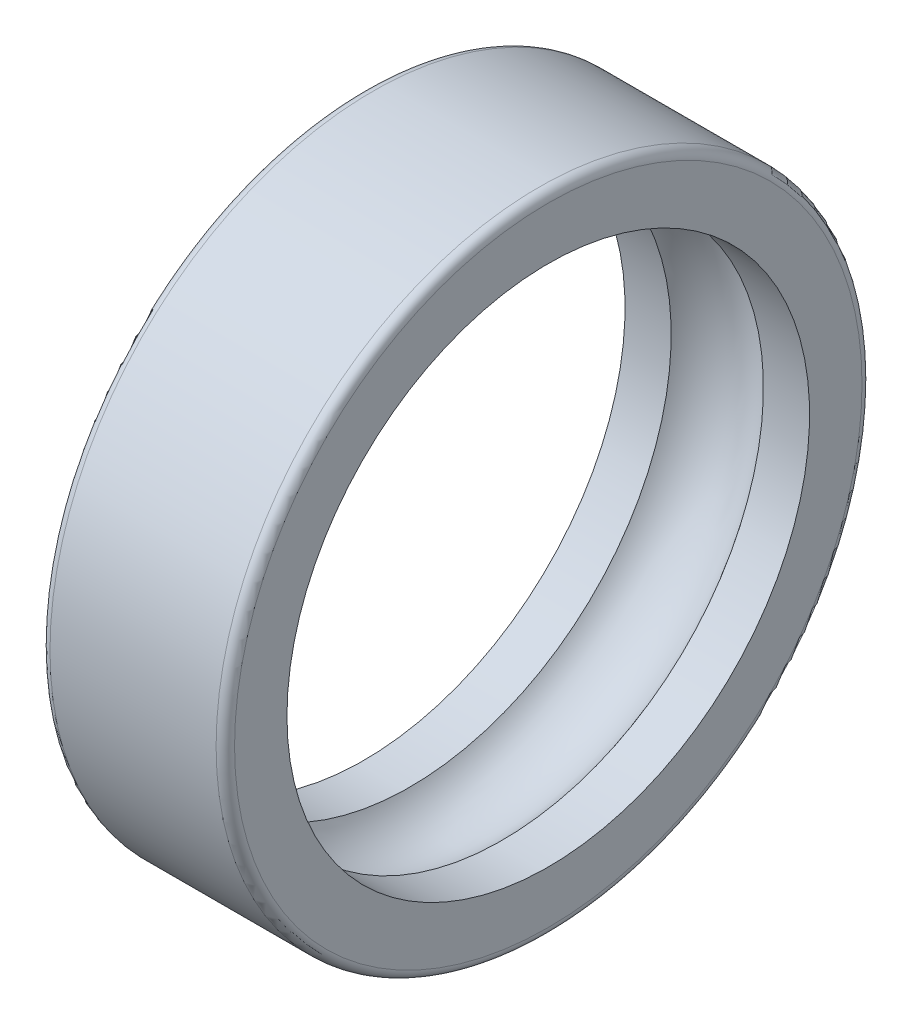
ISO-10303-21;
HEADER;
FILE_DESCRIPTION(('STEP AP214'),'2;1');
FILE_NAME('part.step','',(''),(''),'','','');
FILE_SCHEMA(('AUTOMOTIVE_DESIGN { 1 0 10303 214 1 1 1 1 }'));
ENDSEC;
DATA;
#1=APPLICATION_CONTEXT('core data for automotive mechanical design processes');
#2=APPLICATION_PROTOCOL_DEFINITION('international standard','automotive_design',2000,#1);
#3=PRODUCT_CONTEXT('',#1,'mechanical');
#4=PRODUCT('Part','Part','',(#3));
#5=PRODUCT_RELATED_PRODUCT_CATEGORY('part','',(#4));
#6=PRODUCT_DEFINITION_FORMATION('','',#4);
#7=PRODUCT_DEFINITION_CONTEXT('part definition',#1,'design');
#8=PRODUCT_DEFINITION('design','',#6,#7);
#9=PRODUCT_DEFINITION_SHAPE('','',#8);
#10=(LENGTH_UNIT() NAMED_UNIT(*) SI_UNIT(.MILLI.,.METRE.));
#11=(NAMED_UNIT(*) PLANE_ANGLE_UNIT() SI_UNIT($,.RADIAN.));
#12=(NAMED_UNIT(*) SI_UNIT($,.STERADIAN.) SOLID_ANGLE_UNIT());
#13=UNCERTAINTY_MEASURE_WITH_UNIT(LENGTH_MEASURE(1.E-05),#10,'distance_accuracy_value','');
#14=(GEOMETRIC_REPRESENTATION_CONTEXT(3) GLOBAL_UNCERTAINTY_ASSIGNED_CONTEXT((#13)) GLOBAL_UNIT_ASSIGNED_CONTEXT((#10,
#11,#12)) REPRESENTATION_CONTEXT('',''));
#15=CARTESIAN_POINT('',(0.,0.,0.));
#16=DIRECTION('',(0.,0.,1.));
#17=DIRECTION('',(1.,0.,0.));
#18=AXIS2_PLACEMENT_3D('',#15,#16,#17);
#19=CARTESIAN_POINT('',(0.400000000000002,0.,0.));
#20=DIRECTION('',(-1.,0.,0.));
#21=DIRECTION('',(0.,0.,1.));
#22=AXIS2_PLACEMENT_3D('',#19,#20,#21);
#23=TOROIDAL_SURFACE('',#22,13.6,0.400000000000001);
#24=CARTESIAN_POINT('',(0.,0.,0.));
#25=DIRECTION('',(-1.,0.,0.));
#26=DIRECTION('',(0.,0.,1.));
#27=AXIS2_PLACEMENT_3D('',#24,#25,#26);
#28=CIRCLE('',#27,13.6);
#29=CARTESIAN_POINT('',(0.,0.,13.6));
#30=VERTEX_POINT('',#29);
#31=EDGE_CURVE('E10',#30,#30,#28,.T.);
#32=ORIENTED_EDGE('',*,*,#31,.F.);
#33=EDGE_LOOP('',(#32));
#34=FACE_BOUND('',#33,.T.);
#35=CARTESIAN_POINT('',(0.4,0.,0.));
#36=DIRECTION('',(-1.,0.,0.));
#37=DIRECTION('',(0.,0.,1.));
#38=AXIS2_PLACEMENT_3D('',#35,#36,#37);
#39=CIRCLE('',#38,14.);
#40=CARTESIAN_POINT('',(0.4,0.,14.));
#41=VERTEX_POINT('',#40);
#42=EDGE_CURVE('E56',#41,#41,#39,.T.);
#43=ORIENTED_EDGE('',*,*,#42,.T.);
#44=EDGE_LOOP('',(#43));
#45=FACE_BOUND('',#44,.T.);
#46=ADVANCED_FACE('F28',(#34,#45),#23,.T.);
#47=CARTESIAN_POINT('',(0.,13.6,0.));
#48=DIRECTION('',(1.,0.,0.));
#49=DIRECTION('',(0.,0.,-1.));
#50=AXIS2_PLACEMENT_3D('',#47,#48,#49);
#51=PLANE('',#50);
#52=CARTESIAN_POINT('',(0.,0.,0.));
#53=DIRECTION('',(-1.,0.,0.));
#54=DIRECTION('',(0.,0.,1.));
#55=AXIS2_PLACEMENT_3D('',#52,#53,#54);
#56=CIRCLE('',#55,11.328);
#57=CARTESIAN_POINT('',(0.,0.,11.328));
#58=VERTEX_POINT('',#57);
#59=EDGE_CURVE('E34',#58,#58,#56,.T.);
#60=ORIENTED_EDGE('',*,*,#59,.F.);
#61=EDGE_LOOP('',(#60));
#62=FACE_BOUND('',#61,.T.);
#63=ORIENTED_EDGE('',*,*,#31,.T.);
#64=EDGE_LOOP('',(#63));
#65=FACE_BOUND('',#64,.T.);
#66=ADVANCED_FACE('F93',(#62,#65),#51,.F.);
#67=CARTESIAN_POINT('',(8.,0.,0.));
#68=DIRECTION('',(-1.,0.,0.));
#69=DIRECTION('',(0.,0.,1.));
#70=AXIS2_PLACEMENT_3D('',#67,#68,#69);
#71=CYLINDRICAL_SURFACE('',#70,11.328);
#72=CARTESIAN_POINT('',(2.00089620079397,0.,0.));
#73=DIRECTION('',(-1.,0.,0.));
#74=DIRECTION('',(0.,0.,1.));
#75=AXIS2_PLACEMENT_3D('',#72,#73,#74);
#76=CIRCLE('',#75,11.328);
#77=CARTESIAN_POINT('',(2.00089620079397,0.,11.328));
#78=VERTEX_POINT('',#77);
#79=EDGE_CURVE('E38',#78,#78,#76,.T.);
#80=ORIENTED_EDGE('',*,*,#79,.F.);
#81=EDGE_LOOP('',(#80));
#82=FACE_BOUND('',#81,.T.);
#83=ORIENTED_EDGE('',*,*,#59,.T.);
#84=EDGE_LOOP('',(#83));
#85=FACE_BOUND('',#84,.T.);
#86=ADVANCED_FACE('F88',(#82,#85),#71,.F.);
#87=CARTESIAN_POINT('',(4.,0.,0.));
#88=DIRECTION('',(-1.,0.,0.));
#89=DIRECTION('',(0.,0.,1.));
#90=AXIS2_PLACEMENT_3D('',#87,#88,#89);
#91=TOROIDAL_SURFACE('',#90,10.,2.4);
#92=CARTESIAN_POINT('',(5.99910379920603,0.,0.));
#93=DIRECTION('',(-1.,0.,0.));
#94=DIRECTION('',(0.,0.,1.));
#95=AXIS2_PLACEMENT_3D('',#92,#93,#94);
#96=CIRCLE('',#95,11.328);
#97=CARTESIAN_POINT('',(5.99910379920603,0.,11.328));
#98=VERTEX_POINT('',#97);
#99=EDGE_CURVE('E42',#98,#98,#96,.T.);
#100=ORIENTED_EDGE('',*,*,#99,.F.);
#101=EDGE_LOOP('',(#100));
#102=FACE_BOUND('',#101,.T.);
#103=ORIENTED_EDGE('',*,*,#79,.T.);
#104=EDGE_LOOP('',(#103));
#105=FACE_BOUND('',#104,.T.);
#106=ADVANCED_FACE('F82',(#102,#105),#91,.F.);
#107=CARTESIAN_POINT('',(8.,0.,0.));
#108=DIRECTION('',(-1.,0.,0.));
#109=DIRECTION('',(0.,0.,1.));
#110=AXIS2_PLACEMENT_3D('',#107,#108,#109);
#111=CYLINDRICAL_SURFACE('',#110,11.328);
#112=CARTESIAN_POINT('',(8.,0.,0.));
#113=DIRECTION('',(-1.,0.,0.));
#114=DIRECTION('',(0.,0.,1.));
#115=AXIS2_PLACEMENT_3D('',#112,#113,#114);
#116=CIRCLE('',#115,11.328);
#117=CARTESIAN_POINT('',(8.,0.,11.328));
#118=VERTEX_POINT('',#117);
#119=EDGE_CURVE('E47',#118,#118,#116,.T.);
#120=ORIENTED_EDGE('',*,*,#119,.F.);
#121=EDGE_LOOP('',(#120));
#122=FACE_BOUND('',#121,.T.);
#123=ORIENTED_EDGE('',*,*,#99,.T.);
#124=EDGE_LOOP('',(#123));
#125=FACE_BOUND('',#124,.T.);
#126=ADVANCED_FACE('F76',(#122,#125),#111,.F.);
#127=CARTESIAN_POINT('',(8.,11.328,0.));
#128=DIRECTION('',(-1.,0.,0.));
#129=DIRECTION('',(0.,0.,1.));
#130=AXIS2_PLACEMENT_3D('',#127,#128,#129);
#131=PLANE('',#130);
#132=CARTESIAN_POINT('',(8.,0.,0.));
#133=DIRECTION('',(-1.,0.,0.));
#134=DIRECTION('',(0.,0.,1.));
#135=AXIS2_PLACEMENT_3D('',#132,#133,#134);
#136=CIRCLE('',#135,13.6);
#137=CARTESIAN_POINT('',(8.,0.,13.6));
#138=VERTEX_POINT('',#137);
#139=EDGE_CURVE('E50',#138,#138,#136,.T.);
#140=ORIENTED_EDGE('',*,*,#139,.F.);
#141=EDGE_LOOP('',(#140));
#142=FACE_BOUND('',#141,.T.);
#143=ORIENTED_EDGE('',*,*,#119,.T.);
#144=EDGE_LOOP('',(#143));
#145=FACE_BOUND('',#144,.T.);
#146=ADVANCED_FACE('F70',(#142,#145),#131,.F.);
#147=CARTESIAN_POINT('',(7.6,0.,0.));
#148=DIRECTION('',(-1.,0.,0.));
#149=DIRECTION('',(0.,0.,1.));
#150=AXIS2_PLACEMENT_3D('',#147,#148,#149);
#151=TOROIDAL_SURFACE('',#150,13.6,0.400000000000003);
#152=CARTESIAN_POINT('',(7.6,0.,0.));
#153=DIRECTION('',(-1.,0.,0.));
#154=DIRECTION('',(0.,0.,1.));
#155=AXIS2_PLACEMENT_3D('',#152,#153,#154);
#156=CIRCLE('',#155,14.);
#157=CARTESIAN_POINT('',(7.6,0.,14.));
#158=VERTEX_POINT('',#157);
#159=EDGE_CURVE('E53',#158,#158,#156,.T.);
#160=ORIENTED_EDGE('',*,*,#159,.F.);
#161=EDGE_LOOP('',(#160));
#162=FACE_BOUND('',#161,.T.);
#163=ORIENTED_EDGE('',*,*,#139,.T.);
#164=EDGE_LOOP('',(#163));
#165=FACE_BOUND('',#164,.T.);
#166=ADVANCED_FACE('F64',(#162,#165),#151,.T.);
#167=CARTESIAN_POINT('',(8.,0.,0.));
#168=DIRECTION('',(-1.,0.,0.));
#169=DIRECTION('',(0.,0.,1.));
#170=AXIS2_PLACEMENT_3D('',#167,#168,#169);
#171=CYLINDRICAL_SURFACE('',#170,14.);
#172=ORIENTED_EDGE('',*,*,#42,.F.);
#173=EDGE_LOOP('',(#172));
#174=FACE_BOUND('',#173,.T.);
#175=ORIENTED_EDGE('',*,*,#159,.T.);
#176=EDGE_LOOP('',(#175));
#177=FACE_BOUND('',#176,.T.);
#178=ADVANCED_FACE('F61',(#174,#177),#171,.T.);
#179=CLOSED_SHELL('',(#46,#66,#86,#106,#126,#146,#166,#178));
#180=MANIFOLD_SOLID_BREP('B2',#179);
#181=ADVANCED_BREP_SHAPE_REPRESENTATION('',(#18,#180),#14);
#182=SHAPE_DEFINITION_REPRESENTATION(#9,#181);
ENDSEC;
END-ISO-10303-21;
